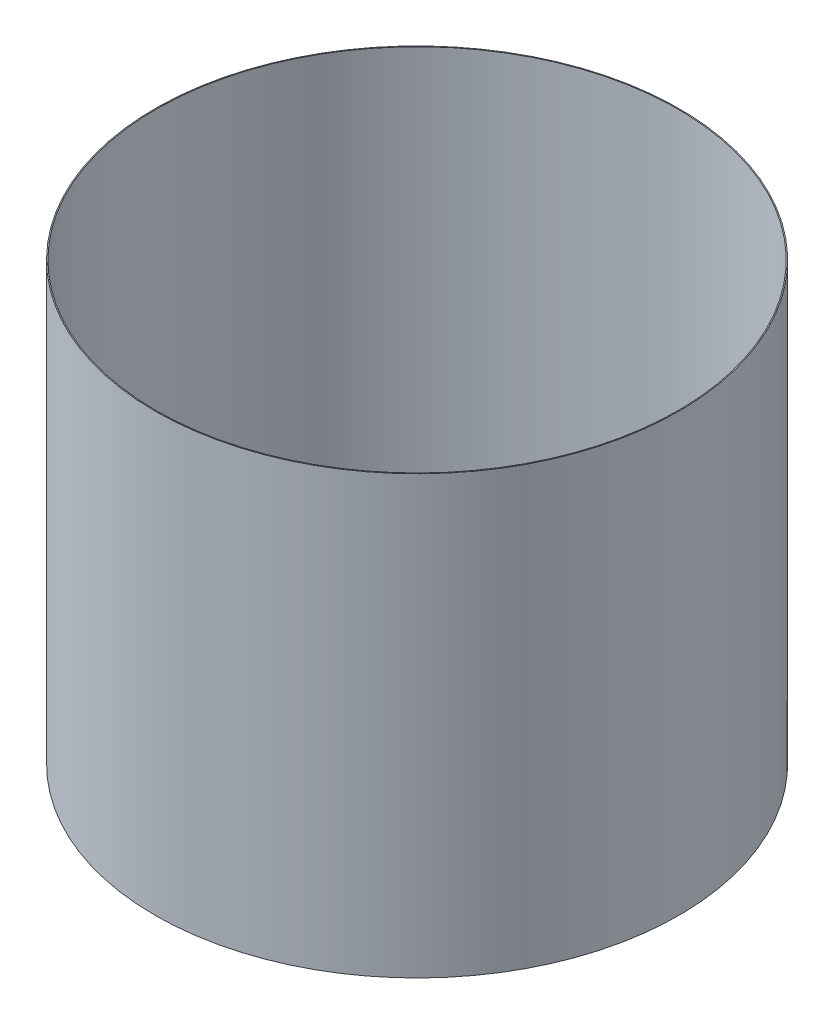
ISO-10303-21;
HEADER;
FILE_DESCRIPTION(('STEP AP214'),'2;1');
FILE_NAME('part.step','',(''),(''),'','','');
FILE_SCHEMA(('AUTOMOTIVE_DESIGN { 1 0 10303 214 1 1 1 1 }'));
ENDSEC;
DATA;
#1=APPLICATION_CONTEXT('core data for automotive mechanical design processes');
#2=APPLICATION_PROTOCOL_DEFINITION('international standard','automotive_design',2000,#1);
#3=PRODUCT_CONTEXT('',#1,'mechanical');
#4=PRODUCT('Part','Part','',(#3));
#5=PRODUCT_RELATED_PRODUCT_CATEGORY('part','',(#4));
#6=PRODUCT_DEFINITION_FORMATION('','',#4);
#7=PRODUCT_DEFINITION_CONTEXT('part definition',#1,'design');
#8=PRODUCT_DEFINITION('design','',#6,#7);
#9=PRODUCT_DEFINITION_SHAPE('','',#8);
#10=(LENGTH_UNIT() NAMED_UNIT(*) SI_UNIT(.MILLI.,.METRE.));
#11=(NAMED_UNIT(*) PLANE_ANGLE_UNIT() SI_UNIT($,.RADIAN.));
#12=(NAMED_UNIT(*) SI_UNIT($,.STERADIAN.) SOLID_ANGLE_UNIT());
#13=UNCERTAINTY_MEASURE_WITH_UNIT(LENGTH_MEASURE(1.E-05),#10,'distance_accuracy_value','');
#14=(GEOMETRIC_REPRESENTATION_CONTEXT(3) GLOBAL_UNCERTAINTY_ASSIGNED_CONTEXT((#13)) GLOBAL_UNIT_ASSIGNED_CONTEXT((#10,
#11,#12)) REPRESENTATION_CONTEXT('',''));
#15=CARTESIAN_POINT('',(0.,0.,0.));
#16=DIRECTION('',(0.,0.,1.));
#17=DIRECTION('',(1.,0.,0.));
#18=AXIS2_PLACEMENT_3D('',#15,#16,#17);
#19=CARTESIAN_POINT('',(0.,55.,0.));
#20=DIRECTION('',(0.,-1.,0.));
#21=DIRECTION('',(0.,0.,-1.));
#22=AXIS2_PLACEMENT_3D('',#19,#20,#21);
#23=CYLINDRICAL_SURFACE('',#22,33.);
#24=CARTESIAN_POINT('',(0.,55.,0.));
#25=DIRECTION('',(0.,1.,0.));
#26=DIRECTION('',(0.,0.,1.));
#27=AXIS2_PLACEMENT_3D('',#24,#25,#26);
#28=CIRCLE('',#27,33.);
#29=CARTESIAN_POINT('',(0.,55.,33.));
#30=VERTEX_POINT('',#29);
#31=EDGE_CURVE('E10',#30,#30,#28,.T.);
#32=ORIENTED_EDGE('',*,*,#31,.F.);
#33=EDGE_LOOP('',(#32));
#34=FACE_BOUND('',#33,.T.);
#35=CARTESIAN_POINT('',(0.,0.,0.));
#36=DIRECTION('',(0.,1.,0.));
#37=DIRECTION('',(0.,0.,1.));
#38=AXIS2_PLACEMENT_3D('',#35,#36,#37);
#39=CIRCLE('',#38,33.);
#40=CARTESIAN_POINT('',(0.,0.,33.));
#41=VERTEX_POINT('',#40);
#42=EDGE_CURVE('E40',#41,#41,#39,.T.);
#43=ORIENTED_EDGE('',*,*,#42,.T.);
#44=EDGE_LOOP('',(#43));
#45=FACE_BOUND('',#44,.T.);
#46=ADVANCED_FACE('F37',(#34,#45),#23,.T.);
#47=CARTESIAN_POINT('',(0.,55.,0.));
#48=DIRECTION('',(0.,1.,0.));
#49=DIRECTION('',(0.,0.,1.));
#50=AXIS2_PLACEMENT_3D('',#47,#48,#49);
#51=PLANE('',#50);
#52=CARTESIAN_POINT('',(0.,55.,0.));
#53=DIRECTION('',(0.,1.,0.));
#54=DIRECTION('',(0.,0.,1.));
#55=AXIS2_PLACEMENT_3D('',#52,#53,#54);
#56=CIRCLE('',#55,32.88);
#57=CARTESIAN_POINT('',(0.,55.,32.88));
#58=VERTEX_POINT('',#57);
#59=EDGE_CURVE('E47',#58,#58,#56,.T.);
#60=ORIENTED_EDGE('',*,*,#59,.F.);
#61=EDGE_LOOP('',(#60));
#62=FACE_BOUND('',#61,.T.);
#63=ORIENTED_EDGE('',*,*,#31,.T.);
#64=EDGE_LOOP('',(#63));
#65=FACE_BOUND('',#64,.T.);
#66=ADVANCED_FACE('F68',(#62,#65),#51,.T.);
#67=CARTESIAN_POINT('',(0.,0.,0.));
#68=DIRECTION('',(0.,1.,0.));
#69=DIRECTION('',(0.,0.,1.));
#70=AXIS2_PLACEMENT_3D('',#67,#68,#69);
#71=PLANE('',#70);
#72=ORIENTED_EDGE('',*,*,#42,.F.);
#73=EDGE_LOOP('',(#72));
#74=FACE_BOUND('',#73,.T.);
#75=ADVANCED_FACE('F59',(#74),#71,.F.);
#76=CARTESIAN_POINT('',(0.,55.,0.));
#77=DIRECTION('',(0.,-1.,0.));
#78=DIRECTION('',(0.,0.,-1.));
#79=AXIS2_PLACEMENT_3D('',#76,#77,#78);
#80=CYLINDRICAL_SURFACE('',#79,32.88);
#81=ORIENTED_EDGE('',*,*,#59,.T.);
#82=EDGE_LOOP('',(#81));
#83=FACE_BOUND('',#82,.T.);
#84=CARTESIAN_POINT('',(0.,0.120000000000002,0.));
#85=DIRECTION('',(0.,1.,0.));
#86=DIRECTION('',(0.,0.,1.));
#87=AXIS2_PLACEMENT_3D('',#84,#85,#86);
#88=CIRCLE('',#87,32.88);
#89=CARTESIAN_POINT('',(0.,0.120000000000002,32.88));
#90=VERTEX_POINT('',#89);
#91=EDGE_CURVE('E51',#90,#90,#88,.T.);
#92=ORIENTED_EDGE('',*,*,#91,.F.);
#93=EDGE_LOOP('',(#92));
#94=FACE_BOUND('',#93,.T.);
#95=ADVANCED_FACE('F57',(#83,#94),#80,.F.);
#96=CARTESIAN_POINT('',(0.,0.12,0.));
#97=DIRECTION('',(0.,1.,0.));
#98=DIRECTION('',(0.,0.,1.));
#99=AXIS2_PLACEMENT_3D('',#96,#97,#98);
#100=PLANE('',#99);
#101=ORIENTED_EDGE('',*,*,#91,.T.);
#102=EDGE_LOOP('',(#101));
#103=FACE_BOUND('',#102,.T.);
#104=ADVANCED_FACE('F55',(#103),#100,.T.);
#105=CLOSED_SHELL('',(#46,#66,#75,#95,#104));
#106=MANIFOLD_SOLID_BREP('B2',#105);
#107=ADVANCED_BREP_SHAPE_REPRESENTATION('',(#18,#106),#14);
#108=SHAPE_DEFINITION_REPRESENTATION(#9,#107);
ENDSEC;
END-ISO-10303-21;
